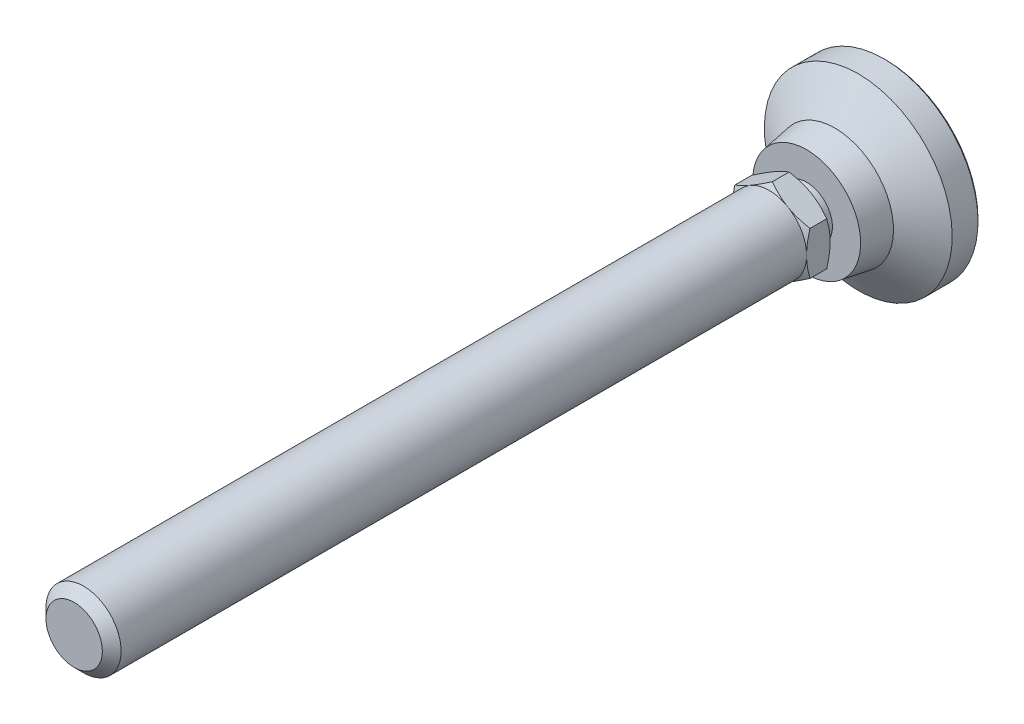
ISO-10303-21;
HEADER;
FILE_DESCRIPTION(('STEP AP214'),'2;1');
FILE_NAME('part.step','',(''),(''),'','','');
FILE_SCHEMA(('AUTOMOTIVE_DESIGN { 1 0 10303 214 1 1 1 1 }'));
ENDSEC;
DATA;
#1=APPLICATION_CONTEXT('core data for automotive mechanical design processes');
#2=APPLICATION_PROTOCOL_DEFINITION('international standard','automotive_design',2000,#1);
#3=PRODUCT_CONTEXT('',#1,'mechanical');
#4=PRODUCT('Part','Part','',(#3));
#5=PRODUCT_RELATED_PRODUCT_CATEGORY('part','',(#4));
#6=PRODUCT_DEFINITION_FORMATION('','',#4);
#7=PRODUCT_DEFINITION_CONTEXT('part definition',#1,'design');
#8=PRODUCT_DEFINITION('design','',#6,#7);
#9=PRODUCT_DEFINITION_SHAPE('','',#8);
#10=(LENGTH_UNIT() NAMED_UNIT(*) SI_UNIT(.MILLI.,.METRE.));
#11=(NAMED_UNIT(*) PLANE_ANGLE_UNIT() SI_UNIT($,.RADIAN.));
#12=(NAMED_UNIT(*) SI_UNIT($,.STERADIAN.) SOLID_ANGLE_UNIT());
#13=UNCERTAINTY_MEASURE_WITH_UNIT(LENGTH_MEASURE(1.E-05),#10,'distance_accuracy_value','');
#14=(GEOMETRIC_REPRESENTATION_CONTEXT(3) GLOBAL_UNCERTAINTY_ASSIGNED_CONTEXT((#13)) GLOBAL_UNIT_ASSIGNED_CONTEXT((#10,
#11,#12)) REPRESENTATION_CONTEXT('',''));
#15=CARTESIAN_POINT('',(0.,0.,0.));
#16=DIRECTION('',(0.,0.,1.));
#17=DIRECTION('',(1.,0.,0.));
#18=AXIS2_PLACEMENT_3D('',#15,#16,#17);
#19=CARTESIAN_POINT('',(0.,0.,-1.));
#20=DIRECTION('',(0.,0.,-1.));
#21=DIRECTION('',(0.,1.,0.));
#22=AXIS2_PLACEMENT_3D('',#19,#20,#21);
#23=CYLINDRICAL_SURFACE('',#22,20.);
#24=CARTESIAN_POINT('',(0.,0.,0.500000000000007));
#25=DIRECTION('',(0.,0.,-1.));
#26=DIRECTION('',(0.,1.,0.));
#27=AXIS2_PLACEMENT_3D('',#24,#25,#26);
#28=CIRCLE('',#27,20.);
#29=CARTESIAN_POINT('',(0.,20.,0.500000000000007));
#30=VERTEX_POINT('',#29);
#31=EDGE_CURVE('E163',#30,#30,#28,.F.);
#32=ORIENTED_EDGE('',*,*,#31,.T.);
#33=EDGE_LOOP('',(#32));
#34=FACE_BOUND('',#33,.T.);
#35=CARTESIAN_POINT('',(0.,0.,6.));
#36=DIRECTION('',(0.,0.,-1.));
#37=DIRECTION('',(0.,1.,0.));
#38=AXIS2_PLACEMENT_3D('',#35,#36,#37);
#39=CIRCLE('',#38,20.);
#40=CARTESIAN_POINT('',(0.,20.,6.));
#41=VERTEX_POINT('',#40);
#42=EDGE_CURVE('E143',#41,#41,#39,.T.);
#43=ORIENTED_EDGE('',*,*,#42,.T.);
#44=EDGE_LOOP('',(#43));
#45=FACE_BOUND('',#44,.T.);
#46=ADVANCED_FACE('F14',(#34,#45),#23,.T.);
#47=CARTESIAN_POINT('',(0.,0.,-1.));
#48=DIRECTION('',(0.,0.,-1.));
#49=DIRECTION('',(0.,1.,0.));
#50=AXIS2_PLACEMENT_3D('',#47,#48,#49);
#51=CYLINDRICAL_SURFACE('',#50,5.50000000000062);
#52=CARTESIAN_POINT('',(0.,0.,17.));
#53=DIRECTION('',(0.,0.,-1.));
#54=DIRECTION('',(0.,1.,0.));
#55=AXIS2_PLACEMENT_3D('',#52,#53,#54);
#56=CIRCLE('',#55,5.50000000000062);
#57=CARTESIAN_POINT('',(0.,5.50000000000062,17.));
#58=VERTEX_POINT('',#57);
#59=EDGE_CURVE('E153',#58,#58,#56,.T.);
#60=ORIENTED_EDGE('',*,*,#59,.F.);
#61=EDGE_LOOP('',(#60));
#62=FACE_BOUND('',#61,.T.);
#63=CARTESIAN_POINT('',(0.,0.,19.9999999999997));
#64=DIRECTION('',(0.,0.,-1.));
#65=DIRECTION('',(0.,1.,0.));
#66=AXIS2_PLACEMENT_3D('',#63,#64,#65);
#67=CIRCLE('',#66,5.50000000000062);
#68=CARTESIAN_POINT('',(0.,5.50000000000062,19.9999999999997));
#69=VERTEX_POINT('',#68);
#70=EDGE_CURVE('E134',#69,#69,#67,.T.);
#71=ORIENTED_EDGE('',*,*,#70,.T.);
#72=EDGE_LOOP('',(#71));
#73=FACE_BOUND('',#72,.T.);
#74=ADVANCED_FACE('F293',(#62,#73),#51,.T.);
#75=CARTESIAN_POINT('',(-11.5,0.,17.));
#76=DIRECTION('',(0.,0.,-1.));
#77=DIRECTION('',(0.,1.,0.));
#78=AXIS2_PLACEMENT_3D('',#75,#76,#77);
#79=PLANE('',#78);
#80=CARTESIAN_POINT('',(0.,0.,17.));
#81=DIRECTION('',(0.,0.,-1.));
#82=DIRECTION('',(0.,1.,0.));
#83=AXIS2_PLACEMENT_3D('',#80,#81,#82);
#84=CIRCLE('',#83,11.5);
#85=CARTESIAN_POINT('',(0.,11.5,17.));
#86=VERTEX_POINT('',#85);
#87=EDGE_CURVE('E150',#86,#86,#84,.T.);
#88=ORIENTED_EDGE('',*,*,#87,.F.);
#89=EDGE_LOOP('',(#88));
#90=FACE_BOUND('',#89,.T.);
#91=ORIENTED_EDGE('',*,*,#59,.T.);
#92=EDGE_LOOP('',(#91));
#93=FACE_BOUND('',#92,.T.);
#94=ADVANCED_FACE('F299',(#90,#93),#79,.F.);
#95=CARTESIAN_POINT('',(0.,0.,17.));
#96=DIRECTION('',(0.,0.,-1.));
#97=DIRECTION('',(0.,1.,0.));
#98=AXIS2_PLACEMENT_3D('',#95,#96,#97);
#99=CONICAL_SURFACE('',#98,11.5,0.165148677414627);
#100=CARTESIAN_POINT('',(0.,0.,11.));
#101=DIRECTION('',(0.,0.,-1.));
#102=DIRECTION('',(0.,1.,0.));
#103=AXIS2_PLACEMENT_3D('',#100,#101,#102);
#104=CIRCLE('',#103,12.5);
#105=CARTESIAN_POINT('',(0.,12.5,11.));
#106=VERTEX_POINT('',#105);
#107=EDGE_CURVE('E146',#106,#106,#104,.T.);
#108=ORIENTED_EDGE('',*,*,#107,.F.);
#109=EDGE_LOOP('',(#108));
#110=FACE_BOUND('',#109,.T.);
#111=ORIENTED_EDGE('',*,*,#87,.T.);
#112=EDGE_LOOP('',(#111));
#113=FACE_BOUND('',#112,.T.);
#114=ADVANCED_FACE('F308',(#110,#113),#99,.T.);
#115=CARTESIAN_POINT('',(0.,0.,11.));
#116=DIRECTION('',(0.,0.,-1.));
#117=DIRECTION('',(0.,1.,0.));
#118=AXIS2_PLACEMENT_3D('',#115,#116,#117);
#119=CONICAL_SURFACE('',#118,12.5,0.982793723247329);
#120=ORIENTED_EDGE('',*,*,#42,.F.);
#121=EDGE_LOOP('',(#120));
#122=FACE_BOUND('',#121,.T.);
#123=ORIENTED_EDGE('',*,*,#107,.T.);
#124=EDGE_LOOP('',(#123));
#125=FACE_BOUND('',#124,.T.);
#126=ADVANCED_FACE('F304',(#122,#125),#119,.T.);
#127=CARTESIAN_POINT('',(0.,0.,0.));
#128=DIRECTION('',(0.,0.,-1.));
#129=DIRECTION('',(0.,1.,0.));
#130=AXIS2_PLACEMENT_3D('',#127,#128,#129);
#131=PLANE('',#130);
#132=CARTESIAN_POINT('',(0.,0.,0.));
#133=DIRECTION('',(0.,0.,-1.));
#134=DIRECTION('',(0.,1.,0.));
#135=AXIS2_PLACEMENT_3D('',#132,#133,#134);
#136=CIRCLE('',#135,19.5);
#137=CARTESIAN_POINT('',(0.,19.5,0.));
#138=VERTEX_POINT('',#137);
#139=EDGE_CURVE('E160',#138,#138,#136,.T.);
#140=ORIENTED_EDGE('',*,*,#139,.T.);
#141=EDGE_LOOP('',(#140));
#142=FACE_BOUND('',#141,.T.);
#143=ADVANCED_FACE('F307',(#142),#131,.T.);
#144=CARTESIAN_POINT('',(0.,-5.50000000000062,19.9999999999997));
#145=DIRECTION('',(0.,0.,-1.));
#146=DIRECTION('',(0.,1.,0.));
#147=AXIS2_PLACEMENT_3D('',#144,#145,#146);
#148=PLANE('',#147);
#149=CARTESIAN_POINT('',(0.,0.,19.9999999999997));
#150=DIRECTION('',(0.,0.,1.));
#151=DIRECTION('',(0.,-1.,0.));
#152=AXIS2_PLACEMENT_3D('',#149,#150,#151);
#153=CIRCLE('',#152,8.00000000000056);
#154=CARTESIAN_POINT('',(-4.,6.92820323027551,19.9999999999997));
#155=VERTEX_POINT('',#154);
#156=CARTESIAN_POINT('',(-8.,0.,19.9999999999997));
#157=VERTEX_POINT('',#156);
#158=EDGE_CURVE('E397',#155,#157,#153,.T.);
#159=ORIENTED_EDGE('',*,*,#158,.F.);
#160=CARTESIAN_POINT('',(4.,6.92820323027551,19.9999999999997));
#161=VERTEX_POINT('',#160);
#162=EDGE_CURVE('E115',#161,#155,#153,.T.);
#163=ORIENTED_EDGE('',*,*,#162,.F.);
#164=CARTESIAN_POINT('',(8.,0.,19.9999999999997));
#165=VERTEX_POINT('',#164);
#166=EDGE_CURVE('E403',#165,#161,#153,.T.);
#167=ORIENTED_EDGE('',*,*,#166,.F.);
#168=CARTESIAN_POINT('',(4.,-6.92820323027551,19.9999999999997));
#169=VERTEX_POINT('',#168);
#170=EDGE_CURVE('E35',#169,#165,#153,.T.);
#171=ORIENTED_EDGE('',*,*,#170,.F.);
#172=CARTESIAN_POINT('',(-4.,-6.92820323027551,19.9999999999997));
#173=VERTEX_POINT('',#172);
#174=EDGE_CURVE('E43',#173,#169,#153,.T.);
#175=ORIENTED_EDGE('',*,*,#174,.F.);
#176=EDGE_CURVE('E400',#157,#173,#153,.T.);
#177=ORIENTED_EDGE('',*,*,#176,.F.);
#178=EDGE_LOOP('',(#159,#163,#167,#171,#175,#177));
#179=FACE_BOUND('',#178,.T.);
#180=ORIENTED_EDGE('',*,*,#70,.F.);
#181=EDGE_LOOP('',(#180));
#182=FACE_BOUND('',#181,.T.);
#183=ADVANCED_FACE('F386',(#179,#182),#148,.T.);
#184=CARTESIAN_POINT('',(0.,0.,0.));
#185=DIRECTION('',(0.,0.,1.));
#186=DIRECTION('',(0.,-1.,0.));
#187=AXIS2_PLACEMENT_3D('',#184,#185,#186);
#188=CONICAL_SURFACE('',#187,19.5,0.785398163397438);
#189=ORIENTED_EDGE('',*,*,#31,.F.);
#190=EDGE_LOOP('',(#189));
#191=FACE_BOUND('',#190,.T.);
#192=ORIENTED_EDGE('',*,*,#139,.F.);
#193=EDGE_LOOP('',(#192));
#194=FACE_BOUND('',#193,.T.);
#195=ADVANCED_FACE('F16',(#191,#194),#188,.T.);
#196=CARTESIAN_POINT('',(0.,0.,19.9999999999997));
#197=DIRECTION('',(0.,0.,1.));
#198=DIRECTION('',(0.,-1.,0.));
#199=AXIS2_PLACEMENT_3D('',#196,#197,#198);
#200=CONICAL_SURFACE('',#199,8.00000000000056,1.0471975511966);
#201=CARTESIAN_POINT('',(-0.00019999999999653,9.23771977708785,20.7145978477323));
#202=CARTESIAN_POINT('',(0.1756487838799,9.13619343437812,20.6559907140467));
#203=CARTESIAN_POINT('',(0.352153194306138,9.03428856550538,20.6000434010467));
#204=CARTESIAN_POINT('',(0.706595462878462,8.82965122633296,20.494201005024));
#205=CARTESIAN_POINT('',(0.884533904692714,8.72691841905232,20.4443085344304));
#206=CARTESIAN_POINT('',(1.42119823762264,8.41707512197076,20.3046927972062));
#207=CARTESIAN_POINT('',(1.78204258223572,8.20874154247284,20.2252811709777));
#208=CARTESIAN_POINT('',(2.32203917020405,7.89697436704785,20.1321616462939));
#209=CARTESIAN_POINT('',(2.49957818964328,7.79447216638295,20.1056345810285));
#210=CARTESIAN_POINT('',(2.8554591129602,7.58900421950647,20.0611531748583));
#211=CARTESIAN_POINT('',(3.03380094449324,7.4860385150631,20.043198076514));
#212=CARTESIAN_POINT('',(3.39079168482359,7.27992981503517,20.0163156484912));
#213=CARTESIAN_POINT('',(3.5694400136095,7.17678715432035,20.0073780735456));
#214=CARTESIAN_POINT('',(3.92690170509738,6.97040655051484,19.9987223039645));
#215=CARTESIAN_POINT('',(4.10571506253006,6.86716861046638,19.9990038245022));
#216=CARTESIAN_POINT('',(4.4400133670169,6.67416139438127,20.0081450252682));
#217=CARTESIAN_POINT('',(4.59552190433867,6.58437849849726,20.0158896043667));
#218=CARTESIAN_POINT('',(4.90617476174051,6.40502298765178,20.0382011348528));
#219=CARTESIAN_POINT('',(5.06131905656,6.31545038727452,20.0527685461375));
#220=CARTESIAN_POINT('',(5.52615131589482,6.04707935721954,20.1063606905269));
#221=CARTESIAN_POINT('',(5.83501648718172,5.86875596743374,20.1552686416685));
#222=CARTESIAN_POINT('',(6.4560232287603,5.51021755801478,20.2775394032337));
#223=CARTESIAN_POINT('',(6.76808554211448,5.33004829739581,20.3514205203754));
#224=CARTESIAN_POINT('',(7.38755648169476,4.97239658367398,20.5191001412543));
#225=CARTESIAN_POINT('',(7.69497304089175,4.79490955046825,20.6128592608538));
#226=CARTESIAN_POINT('',(8.0002,4.61868668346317,20.7145978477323));
#227=B_SPLINE_CURVE_WITH_KNOTS('',3,(#201,#202,#203,#204,#205,#206,#207,#208,#209,#210,#211,
#212,#213,#214,#215,#216,#217,#218,#219,#220,#221,#222,#223,#224,#225,#226),.UNSPECIFIED.,.F.,
.F.,(4,2,2,2,2,2,2,2,2,2,2,2,4),(0.,0.63397354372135,1.26821965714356,2.53934712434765,
3.15934343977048,3.77928496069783,4.39852133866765,5.01773858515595,5.55680239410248,
6.09590254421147,7.17487077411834,8.27776850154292,9.37850115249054),.UNSPECIFIED.);
#228=CARTESIAN_POINT('',(0.,9.23760430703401,20.7145311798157));
#229=VERTEX_POINT('',#228);
#230=EDGE_CURVE('E112',#229,#161,#227,.T.);
#231=ORIENTED_EDGE('',*,*,#230,.T.);
#232=ORIENTED_EDGE('',*,*,#162,.T.);
#233=CARTESIAN_POINT('',(-8.0002,4.61868668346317,20.7145978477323));
#234=CARTESIAN_POINT('',(-7.8243512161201,4.7202130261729,20.6559907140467));
#235=CARTESIAN_POINT('',(-7.64784680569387,4.82211789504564,20.6000434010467));
#236=CARTESIAN_POINT('',(-7.29340453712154,5.02675523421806,20.494201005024));
#237=CARTESIAN_POINT('',(-7.11546609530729,5.1294880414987,20.4443085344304));
#238=CARTESIAN_POINT('',(-6.57880176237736,5.43933133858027,20.3046927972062));
#239=CARTESIAN_POINT('',(-6.21795741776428,5.64766491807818,20.2252811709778));
#240=CARTESIAN_POINT('',(-5.67796082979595,5.95943209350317,20.1321616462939));
#241=CARTESIAN_POINT('',(-5.50042181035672,6.06193429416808,20.1056345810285));
#242=CARTESIAN_POINT('',(-5.1445408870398,6.26740224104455,20.0611531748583));
#243=CARTESIAN_POINT('',(-4.96619905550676,6.37036794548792,20.043198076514));
#244=CARTESIAN_POINT('',(-4.60920831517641,6.57647664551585,20.0163156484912));
#245=CARTESIAN_POINT('',(-4.4305599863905,6.67961930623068,20.0073780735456));
#246=CARTESIAN_POINT('',(-4.07309829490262,6.88599991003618,19.9987223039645));
#247=CARTESIAN_POINT('',(-3.89428493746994,6.98923785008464,19.9990038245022));
#248=CARTESIAN_POINT('',(-3.5599866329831,7.18224506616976,20.0081450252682));
#249=CARTESIAN_POINT('',(-3.40447809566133,7.27202796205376,20.0158896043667));
#250=CARTESIAN_POINT('',(-3.09382523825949,7.45138347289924,20.0382011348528));
#251=CARTESIAN_POINT('',(-2.93868094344,7.54095607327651,20.0527685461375));
#252=CARTESIAN_POINT('',(-2.47384868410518,7.80932710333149,20.1063606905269));
#253=CARTESIAN_POINT('',(-2.16498351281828,7.98765049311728,20.1552686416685));
#254=CARTESIAN_POINT('',(-1.5439767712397,8.34618890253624,20.2775394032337));
#255=CARTESIAN_POINT('',(-1.23191445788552,8.52635816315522,20.3514205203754));
#256=CARTESIAN_POINT('',(-0.612443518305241,8.88400987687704,20.5191001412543));
#257=CARTESIAN_POINT('',(-0.305026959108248,9.06149691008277,20.6128592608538));
#258=CARTESIAN_POINT('',(0.000200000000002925,9.23771977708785,20.7145978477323));
#259=B_SPLINE_CURVE_WITH_KNOTS('',3,(#233,#234,#235,#236,#237,#238,#239,#240,#241,#242,#243,
#244,#245,#246,#247,#248,#249,#250,#251,#252,#253,#254,#255,#256,#257,#258),.UNSPECIFIED.,.F.,
.F.,(4,2,2,2,2,2,2,2,2,2,2,2,4),(0.,0.633973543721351,1.26821965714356,2.53934712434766,
3.15934343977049,3.77928496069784,4.39852133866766,5.01773858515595,5.55680239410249,
6.09590254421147,7.17487077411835,8.27776850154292,9.37850115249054),.UNSPECIFIED.);
#260=EDGE_CURVE('E18',#155,#229,#259,.T.);
#261=ORIENTED_EDGE('',*,*,#260,.T.);
#262=EDGE_LOOP('',(#231,#232,#261));
#263=FACE_BOUND('',#262,.T.);
#264=ADVANCED_FACE('F111',(#263),#200,.T.);
#265=CARTESIAN_POINT('',(-8.,12.3152893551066,23.8599232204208));
#266=CARTESIAN_POINT('',(-8.,11.9666358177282,23.6911645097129));
#267=CARTESIAN_POINT('',(-8.,11.6171720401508,23.5240505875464));
#268=CARTESIAN_POINT('',(-8.,10.9161927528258,23.1940392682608));
#269=CARTESIAN_POINT('',(-8.,10.5646769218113,23.0311425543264));
#270=CARTESIAN_POINT('',(-8.,9.85730685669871,22.7096533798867));
#271=CARTESIAN_POINT('',(-8.,9.50143935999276,22.5510899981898));
#272=CARTESIAN_POINT('',(-8.,8.78684181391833,22.2405754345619));
#273=CARTESIAN_POINT('',(-8.,8.4281119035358,22.0886239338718));
#274=CARTESIAN_POINT('',(-8.,7.69599116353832,21.7884789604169));
#275=CARTESIAN_POINT('',(-8.,7.32249146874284,21.6405495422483));
#276=CARTESIAN_POINT('',(-8.,6.57108964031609,21.3561094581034));
#277=CARTESIAN_POINT('',(-8.,6.19318701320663,21.2196000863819));
#278=CARTESIAN_POINT('',(-8.,5.43311095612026,20.9616514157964));
#279=CARTESIAN_POINT('',(-8.,5.05094827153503,20.8401807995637));
#280=CARTESIAN_POINT('',(-8.,4.2811561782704,20.6162657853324));
#281=CARTESIAN_POINT('',(-8.,3.89352856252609,20.5138152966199));
#282=CARTESIAN_POINT('',(-8.,3.11465872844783,20.3334648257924));
#283=CARTESIAN_POINT('',(-8.,2.72344742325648,20.2554349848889));
#284=CARTESIAN_POINT('',(-8.,2.1331422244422,20.1601282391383));
#285=CARTESIAN_POINT('',(-8.,1.93577721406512,20.1319810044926));
#286=CARTESIAN_POINT('',(-8.,1.54009759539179,20.0834865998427));
#287=CARTESIAN_POINT('',(-8.,1.34178308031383,20.0631386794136));
#288=CARTESIAN_POINT('',(-8.,0.947020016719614,20.0308987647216));
#289=CARTESIAN_POINT('',(-8.,0.750580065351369,20.0189018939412));
#290=CARTESIAN_POINT('',(-8.,0.357369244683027,20.0032193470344));
#291=CARTESIAN_POINT('',(-8.,0.160598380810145,19.9995335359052));
#292=CARTESIAN_POINT('',(-8.,-0.232923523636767,20.000560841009));
#293=CARTESIAN_POINT('',(-8.,-0.429674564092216,20.0052740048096));
#294=CARTESIAN_POINT('',(-8.,-0.822805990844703,20.022985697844));
#295=CARTESIAN_POINT('',(-8.,-1.01918635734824,20.0359846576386));
#296=CARTESIAN_POINT('',(-8.,-1.49396474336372,20.0771559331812));
#297=CARTESIAN_POINT('',(-8.,-1.77201548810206,20.1094158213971));
#298=CARTESIAN_POINT('',(-8.,-2.32597953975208,20.1887644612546));
#299=CARTESIAN_POINT('',(-8.,-2.60189253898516,20.2358553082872));
#300=CARTESIAN_POINT('',(-8.,-3.4261516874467,20.3968708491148));
#301=CARTESIAN_POINT('',(-8.,-3.97069415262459,20.5305068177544));
#302=CARTESIAN_POINT('',(-8.,-4.78479126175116,20.7613060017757));
#303=CARTESIAN_POINT('',(-8.,-5.0585921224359,20.8443450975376));
#304=CARTESIAN_POINT('',(-8.,-5.60353316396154,21.0188150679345));
#305=CARTESIAN_POINT('',(-8.,-5.87467332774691,21.1102459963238));
#306=CARTESIAN_POINT('',(-8.,-6.41438262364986,21.3000521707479));
#307=CARTESIAN_POINT('',(-8.,-6.68295262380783,21.3984249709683));
#308=CARTESIAN_POINT('',(-8.,-7.21788349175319,21.6009807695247));
#309=CARTESIAN_POINT('',(-8.,-7.4842443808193,21.7051637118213));
#310=CARTESIAN_POINT('',(-8.,-8.0930800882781,21.9497344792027));
#311=CARTESIAN_POINT('',(-8.,-8.43489667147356,22.0917574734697));
#312=CARTESIAN_POINT('',(-8.,-9.1157796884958,22.382266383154));
#313=CARTESIAN_POINT('',(-8.,-9.4548459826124,22.5307526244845));
#314=CARTESIAN_POINT('',(-8.,-10.1307153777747,22.8329468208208));
#315=CARTESIAN_POINT('',(-8.,-10.4675180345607,22.9866557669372));
#316=CARTESIAN_POINT('',(-8.,-11.1391572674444,23.2982871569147));
#317=CARTESIAN_POINT('',(-8.,-11.4739938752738,23.4562095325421));
#318=CARTESIAN_POINT('',(-8.,-12.1423156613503,23.7756536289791));
#319=CARTESIAN_POINT('',(-8.,-12.475799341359,23.9371784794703));
#320=CARTESIAN_POINT('',(-8.,-13.141362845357,24.2630974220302));
#321=CARTESIAN_POINT('',(-8.,-13.4734426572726,24.4274915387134));
#322=CARTESIAN_POINT('',(-8.,-14.4679137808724,24.924249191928));
#323=CARTESIAN_POINT('',(-8.,-15.1285232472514,25.260181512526));
#324=CARTESIAN_POINT('',(-8.,-16.0907733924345,25.7557573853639));
#325=CARTESIAN_POINT('',(-8.,-16.3937978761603,25.9127307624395));
#326=CARTESIAN_POINT('',(-8.,-16.9991858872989,26.227935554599));
#327=CARTESIAN_POINT('',(-8.,-17.3015494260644,26.3861669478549));
#328=CARTESIAN_POINT('',(-8.,-18.2078023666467,26.8625086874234));
#329=CARTESIAN_POINT('',(-8.,-18.8108317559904,27.1822550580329));
#330=CARTESIAN_POINT('',(-8.,-20.0137415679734,27.8243667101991));
#331=CARTESIAN_POINT('',(-8.,-20.6136260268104,28.1467244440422));
#332=CARTESIAN_POINT('',(-8.,-21.8119289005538,28.7940829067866));
#333=CARTESIAN_POINT('',(-8.,-22.4103473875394,29.1190835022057));
#334=CARTESIAN_POINT('',(-8.,-23.0082202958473,29.4450783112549));
#335=B_SPLINE_CURVE_WITH_KNOTS('',3,(#265,#266,#267,#268,#269,#270,#271,#272,#273,#274,#275,
#276,#277,#278,#279,#280,#281,#282,#283,#284,#285,#286,#287,#288,#289,#290,#291,#292,#293,#294,
#295,#296,#297,#298,#299,#300,#301,#302,#303,#304,#305,#306,#307,#308,#309,#310,#311,#312,#313,
#314,#315,#316,#317,#318,#319,#320,#321,#322,#323,#324,#325,#326,#327,#328,#329,#330,#331,#332,
#333,#334),.UNSPECIFIED.,.F.,.F.,(4,2,2,2,2,2,2,2,2,2,2,2,2,2,2,2,2,2,2,2,2,2,2,2,2,2,2,2,2,2,2,
2,2,2,4),(0.,1.16205987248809,2.32430683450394,3.49303705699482,4.6617108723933,
5.86674910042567,7.07192371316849,8.27454482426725,9.47678015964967,10.6725093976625,
11.2704655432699,11.8683641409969,12.4586115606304,13.0488493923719,13.6390905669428,
14.2293624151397,15.0686339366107,15.9080240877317,17.587776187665,18.4460558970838,
19.3043411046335,20.1623254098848,21.0203014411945,22.1306562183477,23.2410670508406,
24.3516897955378,25.4622945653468,26.5739049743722,27.6855249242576,29.9088098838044,
30.9326156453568,31.9564036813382,34.0040551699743,36.0470810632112,38.0900044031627),.UNSPECIFIED.);
#336=CARTESIAN_POINT('',(-8.,4.61880215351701,20.7145311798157));
#337=VERTEX_POINT('',#336);
#338=EDGE_CURVE('E367',#157,#337,#335,.F.);
#339=ORIENTED_EDGE('',*,*,#338,.T.);
#340=EDGE_CURVE('E9',#337,#155,#259,.T.);
#341=ORIENTED_EDGE('',*,*,#340,.T.);
#342=ORIENTED_EDGE('',*,*,#158,.T.);
#343=EDGE_LOOP('',(#339,#341,#342));
#344=FACE_BOUND('',#343,.T.);
#345=ADVANCED_FACE('F181',(#344),#200,.T.);
#346=CARTESIAN_POINT('',(0.000200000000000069,-9.23771977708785,20.7145978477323));
#347=CARTESIAN_POINT('',(-0.175648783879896,-9.13619343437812,20.6559907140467));
#348=CARTESIAN_POINT('',(-0.352153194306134,-9.03428856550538,20.6000434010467));
#349=CARTESIAN_POINT('',(-0.706595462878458,-8.82965122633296,20.494201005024));
#350=CARTESIAN_POINT('',(-0.88453390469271,-8.72691841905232,20.4443085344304));
#351=CARTESIAN_POINT('',(-1.42119823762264,-8.41707512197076,20.3046927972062));
#352=CARTESIAN_POINT('',(-1.78204258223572,-8.20874154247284,20.2252811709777));
#353=CARTESIAN_POINT('',(-2.32203917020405,-7.89697436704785,20.1321616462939));
#354=CARTESIAN_POINT('',(-2.49957818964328,-7.79447216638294,20.1056345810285));
#355=CARTESIAN_POINT('',(-2.8554591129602,-7.58900421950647,20.0611531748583));
#356=CARTESIAN_POINT('',(-3.03380094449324,-7.4860385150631,20.043198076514));
#357=CARTESIAN_POINT('',(-3.39079168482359,-7.27992981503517,20.0163156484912));
#358=CARTESIAN_POINT('',(-3.5694400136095,-7.17678715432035,20.0073780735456));
#359=CARTESIAN_POINT('',(-3.92690170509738,-6.97040655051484,19.9987223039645));
#360=CARTESIAN_POINT('',(-4.10571506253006,-6.86716861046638,19.9990038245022));
#361=CARTESIAN_POINT('',(-4.4400133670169,-6.67416139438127,20.0081450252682));
#362=CARTESIAN_POINT('',(-4.59552190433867,-6.58437849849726,20.0158896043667));
#363=CARTESIAN_POINT('',(-4.90617476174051,-6.40502298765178,20.0382011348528));
#364=CARTESIAN_POINT('',(-5.06131905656,-6.31545038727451,20.0527685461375));
#365=CARTESIAN_POINT('',(-5.52615131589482,-6.04707935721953,20.1063606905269));
#366=CARTESIAN_POINT('',(-5.83501648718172,-5.86875596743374,20.1552686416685));
#367=CARTESIAN_POINT('',(-6.4560232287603,-5.51021755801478,20.2775394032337));
#368=CARTESIAN_POINT('',(-6.76808554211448,-5.3300482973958,20.3514205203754));
#369=CARTESIAN_POINT('',(-7.38755648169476,-4.97239658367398,20.5191001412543));
#370=CARTESIAN_POINT('',(-7.69497304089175,-4.79490955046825,20.6128592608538));
#371=CARTESIAN_POINT('',(-8.0002,-4.61868668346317,20.7145978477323));
#372=B_SPLINE_CURVE_WITH_KNOTS('',3,(#346,#347,#348,#349,#350,#351,#352,#353,#354,#355,#356,
#357,#358,#359,#360,#361,#362,#363,#364,#365,#366,#367,#368,#369,#370,#371),.UNSPECIFIED.,.F.,
.F.,(4,2,2,2,2,2,2,2,2,2,2,2,4),(0.,0.633973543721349,1.26821965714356,2.53934712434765,
3.15934343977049,3.77928496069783,4.39852133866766,5.01773858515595,5.55680239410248,
6.09590254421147,7.17487077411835,8.27776850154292,9.37850115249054),.UNSPECIFIED.);
#373=CARTESIAN_POINT('',(-8.,-4.618802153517,20.7145311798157));
#374=VERTEX_POINT('',#373);
#375=EDGE_CURVE('E359',#173,#374,#372,.T.);
#376=ORIENTED_EDGE('',*,*,#375,.T.);
#377=EDGE_CURVE('E361',#374,#157,#335,.F.);
#378=ORIENTED_EDGE('',*,*,#377,.T.);
#379=ORIENTED_EDGE('',*,*,#176,.T.);
#380=EDGE_LOOP('',(#376,#378,#379));
#381=FACE_BOUND('',#380,.T.);
#382=ADVANCED_FACE('F417',(#381),#200,.T.);
#383=CARTESIAN_POINT('',(8.0002,-4.61868668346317,20.7145978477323));
#384=CARTESIAN_POINT('',(7.8243512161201,-4.7202130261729,20.6559907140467));
#385=CARTESIAN_POINT('',(7.64784680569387,-4.82211789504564,20.6000434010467));
#386=CARTESIAN_POINT('',(7.29340453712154,-5.02675523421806,20.494201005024));
#387=CARTESIAN_POINT('',(7.11546609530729,-5.1294880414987,20.4443085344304));
#388=CARTESIAN_POINT('',(6.57880176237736,-5.43933133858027,20.3046927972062));
#389=CARTESIAN_POINT('',(6.21795741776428,-5.64766491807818,20.2252811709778));
#390=CARTESIAN_POINT('',(5.67796082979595,-5.95943209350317,20.1321616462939));
#391=CARTESIAN_POINT('',(5.50042181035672,-6.06193429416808,20.1056345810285));
#392=CARTESIAN_POINT('',(5.1445408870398,-6.26740224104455,20.0611531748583));
#393=CARTESIAN_POINT('',(4.96619905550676,-6.37036794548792,20.043198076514));
#394=CARTESIAN_POINT('',(4.60920831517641,-6.57647664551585,20.0163156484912));
#395=CARTESIAN_POINT('',(4.4305599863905,-6.67961930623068,20.0073780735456));
#396=CARTESIAN_POINT('',(4.07309829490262,-6.88599991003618,19.9987223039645));
#397=CARTESIAN_POINT('',(3.89428493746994,-6.98923785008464,19.9990038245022));
#398=CARTESIAN_POINT('',(3.5599866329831,-7.18224506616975,20.0081450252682));
#399=CARTESIAN_POINT('',(3.40447809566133,-7.27202796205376,20.0158896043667));
#400=CARTESIAN_POINT('',(3.09382523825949,-7.45138347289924,20.0382011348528));
#401=CARTESIAN_POINT('',(2.93868094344,-7.54095607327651,20.0527685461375));
#402=CARTESIAN_POINT('',(2.47384868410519,-7.80932710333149,20.1063606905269));
#403=CARTESIAN_POINT('',(2.16498351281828,-7.98765049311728,20.1552686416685));
#404=CARTESIAN_POINT('',(1.5439767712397,-8.34618890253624,20.2775394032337));
#405=CARTESIAN_POINT('',(1.23191445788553,-8.52635816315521,20.3514205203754));
#406=CARTESIAN_POINT('',(0.612443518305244,-8.88400987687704,20.5191001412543));
#407=CARTESIAN_POINT('',(0.305026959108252,-9.06149691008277,20.6128592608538));
#408=CARTESIAN_POINT('',(-0.00019999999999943,-9.23771977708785,20.7145978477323));
#409=B_SPLINE_CURVE_WITH_KNOTS('',3,(#383,#384,#385,#386,#387,#388,#389,#390,#391,#392,#393,
#394,#395,#396,#397,#398,#399,#400,#401,#402,#403,#404,#405,#406,#407,#408),.UNSPECIFIED.,.F.,
.F.,(4,2,2,2,2,2,2,2,2,2,2,2,4),(0.,0.633973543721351,1.26821965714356,2.53934712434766,
3.15934343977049,3.77928496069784,4.39852133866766,5.01773858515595,5.55680239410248,
6.09590254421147,7.17487077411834,8.27776850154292,9.37850115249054),.UNSPECIFIED.);
#410=CARTESIAN_POINT('',(0.,-9.23760430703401,20.7145311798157));
#411=VERTEX_POINT('',#410);
#412=EDGE_CURVE('E244',#169,#411,#409,.T.);
#413=ORIENTED_EDGE('',*,*,#412,.T.);
#414=EDGE_CURVE('E357',#411,#173,#372,.T.);
#415=ORIENTED_EDGE('',*,*,#414,.T.);
#416=ORIENTED_EDGE('',*,*,#174,.T.);
#417=EDGE_LOOP('',(#413,#415,#416));
#418=FACE_BOUND('',#417,.T.);
#419=ADVANCED_FACE('F411',(#418),#200,.T.);
#420=CARTESIAN_POINT('',(8.,12.3152893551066,23.8599232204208));
#421=CARTESIAN_POINT('',(8.,11.9666358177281,23.6911645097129));
#422=CARTESIAN_POINT('',(8.,11.6171720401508,23.5240505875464));
#423=CARTESIAN_POINT('',(8.,10.9161927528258,23.1940392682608));
#424=CARTESIAN_POINT('',(8.,10.5646769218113,23.0311425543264));
#425=CARTESIAN_POINT('',(8.,9.8573068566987,22.7096533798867));
#426=CARTESIAN_POINT('',(8.,9.50143935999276,22.5510899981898));
#427=CARTESIAN_POINT('',(8.,8.78684181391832,22.2405754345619));
#428=CARTESIAN_POINT('',(8.,8.4281119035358,22.0886239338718));
#429=CARTESIAN_POINT('',(8.,7.69599116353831,21.7884789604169));
#430=CARTESIAN_POINT('',(8.,7.32249146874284,21.6405495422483));
#431=CARTESIAN_POINT('',(8.,6.57108964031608,21.3561094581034));
#432=CARTESIAN_POINT('',(8.,6.19318701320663,21.2196000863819));
#433=CARTESIAN_POINT('',(8.,5.43311095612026,20.9616514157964));
#434=CARTESIAN_POINT('',(8.,5.05094827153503,20.8401807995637));
#435=CARTESIAN_POINT('',(8.,4.2811561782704,20.6162657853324));
#436=CARTESIAN_POINT('',(8.,3.89352856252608,20.5138152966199));
#437=CARTESIAN_POINT('',(8.,3.11465872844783,20.3334648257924));
#438=CARTESIAN_POINT('',(8.,2.72344742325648,20.2554349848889));
#439=CARTESIAN_POINT('',(8.,2.1331422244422,20.1601282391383));
#440=CARTESIAN_POINT('',(8.,1.93577721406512,20.1319810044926));
#441=CARTESIAN_POINT('',(8.,1.54009759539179,20.0834865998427));
#442=CARTESIAN_POINT('',(8.,1.34178308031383,20.0631386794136));
#443=CARTESIAN_POINT('',(8.,0.947020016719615,20.0308987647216));
#444=CARTESIAN_POINT('',(8.,0.75058006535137,20.0189018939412));
#445=CARTESIAN_POINT('',(8.,0.357369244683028,20.0032193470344));
#446=CARTESIAN_POINT('',(8.,0.160598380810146,19.9995335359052));
#447=CARTESIAN_POINT('',(8.,-0.232923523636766,20.000560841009));
#448=CARTESIAN_POINT('',(8.,-0.429674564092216,20.0052740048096));
#449=CARTESIAN_POINT('',(8.,-0.822805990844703,20.022985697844));
#450=CARTESIAN_POINT('',(8.,-1.01918635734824,20.0359846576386));
#451=CARTESIAN_POINT('',(8.,-1.49396474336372,20.0771559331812));
#452=CARTESIAN_POINT('',(8.,-1.77201548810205,20.1094158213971));
#453=CARTESIAN_POINT('',(8.,-2.32597953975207,20.1887644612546));
#454=CARTESIAN_POINT('',(8.,-2.60189253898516,20.2358553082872));
#455=CARTESIAN_POINT('',(8.,-3.4261516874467,20.3968708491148));
#456=CARTESIAN_POINT('',(8.,-3.97069415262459,20.5305068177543));
#457=CARTESIAN_POINT('',(8.,-4.78479126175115,20.7613060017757));
#458=CARTESIAN_POINT('',(8.,-5.0585921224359,20.8443450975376));
#459=CARTESIAN_POINT('',(8.,-5.60353316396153,21.0188150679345));
#460=CARTESIAN_POINT('',(8.,-5.8746733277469,21.1102459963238));
#461=CARTESIAN_POINT('',(8.,-6.41438262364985,21.3000521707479));
#462=CARTESIAN_POINT('',(8.,-6.68295262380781,21.3984249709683));
#463=CARTESIAN_POINT('',(8.,-7.21788349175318,21.6009807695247));
#464=CARTESIAN_POINT('',(8.,-7.4842443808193,21.7051637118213));
#465=CARTESIAN_POINT('',(8.,-8.0930800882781,21.9497344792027));
#466=CARTESIAN_POINT('',(8.,-8.43489667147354,22.0917574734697));
#467=CARTESIAN_POINT('',(8.,-9.11577968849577,22.382266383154));
#468=CARTESIAN_POINT('',(8.,-9.45484598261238,22.5307526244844));
#469=CARTESIAN_POINT('',(8.,-10.1307153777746,22.8329468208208));
#470=CARTESIAN_POINT('',(8.,-10.4675180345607,22.9866557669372));
#471=CARTESIAN_POINT('',(8.,-11.1391572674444,23.2982871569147));
#472=CARTESIAN_POINT('',(8.,-11.4739938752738,23.4562095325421));
#473=CARTESIAN_POINT('',(8.,-12.1423156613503,23.7756536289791));
#474=CARTESIAN_POINT('',(8.,-12.4757993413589,23.9371784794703));
#475=CARTESIAN_POINT('',(8.,-13.141362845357,24.2630974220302));
#476=CARTESIAN_POINT('',(8.,-13.4734426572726,24.4274915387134));
#477=CARTESIAN_POINT('',(8.,-14.4679137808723,24.924249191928));
#478=CARTESIAN_POINT('',(8.,-15.1285232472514,25.260181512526));
#479=CARTESIAN_POINT('',(8.,-16.0907733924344,25.7557573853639));
#480=CARTESIAN_POINT('',(8.,-16.3937978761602,25.9127307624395));
#481=CARTESIAN_POINT('',(8.,-16.9991858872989,26.227935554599));
#482=CARTESIAN_POINT('',(8.,-17.3015494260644,26.3861669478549));
#483=CARTESIAN_POINT('',(8.,-18.2078023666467,26.8625086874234));
#484=CARTESIAN_POINT('',(7.99999999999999,-18.8108317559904,27.1822550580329));
#485=CARTESIAN_POINT('',(7.99999999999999,-20.0137415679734,27.8243667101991));
#486=CARTESIAN_POINT('',(7.99999999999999,-20.6136260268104,28.1467244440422));
#487=CARTESIAN_POINT('',(7.99999999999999,-21.8119289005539,28.7940829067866));
#488=CARTESIAN_POINT('',(8.,-22.4103473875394,29.1190835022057));
#489=CARTESIAN_POINT('',(8.,-23.0082202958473,29.4450783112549));
#490=B_SPLINE_CURVE_WITH_KNOTS('',3,(#420,#421,#422,#423,#424,#425,#426,#427,#428,#429,#430,
#431,#432,#433,#434,#435,#436,#437,#438,#439,#440,#441,#442,#443,#444,#445,#446,#447,#448,#449,
#450,#451,#452,#453,#454,#455,#456,#457,#458,#459,#460,#461,#462,#463,#464,#465,#466,#467,#468,
#469,#470,#471,#472,#473,#474,#475,#476,#477,#478,#479,#480,#481,#482,#483,#484,#485,#486,#487,
#488,#489),.UNSPECIFIED.,.F.,.F.,(4,2,2,2,2,2,2,2,2,2,2,2,2,2,2,2,2,2,2,2,2,2,2,2,2,2,2,2,2,2,2,
2,2,2,4),(0.,1.16205987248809,2.32430683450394,3.49303705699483,4.6617108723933,
5.86674910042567,7.07192371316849,8.27454482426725,9.47678015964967,10.6725093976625,
11.2704655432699,11.8683641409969,12.4586115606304,13.0488493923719,13.6390905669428,
14.2293624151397,15.0686339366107,15.9080240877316,17.587776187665,18.4460558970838,
19.3043411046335,20.1623254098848,21.0203014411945,22.1306562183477,23.2410670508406,
24.3516897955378,25.4622945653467,26.5739049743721,27.6855249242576,29.9088098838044,
30.9326156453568,31.9564036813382,34.0040551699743,36.0470810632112,38.0900044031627),.UNSPECIFIED.);
#491=CARTESIAN_POINT('',(8.,-4.61880215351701,20.7145311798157));
#492=VERTEX_POINT('',#491);
#493=EDGE_CURVE('E236',#165,#492,#490,.T.);
#494=ORIENTED_EDGE('',*,*,#493,.T.);
#495=EDGE_CURVE('E243',#492,#169,#409,.T.);
#496=ORIENTED_EDGE('',*,*,#495,.T.);
#497=ORIENTED_EDGE('',*,*,#170,.T.);
#498=EDGE_LOOP('',(#494,#496,#497));
#499=FACE_BOUND('',#498,.T.);
#500=ADVANCED_FACE('F406',(#499),#200,.T.);
#501=CARTESIAN_POINT('',(8.,4.61880215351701,20.7145311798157));
#502=VERTEX_POINT('',#501);
#503=EDGE_CURVE('E127',#161,#502,#227,.T.);
#504=ORIENTED_EDGE('',*,*,#503,.T.);
#505=EDGE_CURVE('E242',#502,#165,#490,.T.);
#506=ORIENTED_EDGE('',*,*,#505,.T.);
#507=ORIENTED_EDGE('',*,*,#166,.T.);
#508=EDGE_LOOP('',(#504,#506,#507));
#509=FACE_BOUND('',#508,.T.);
#510=ADVANCED_FACE('F328',(#509),#200,.T.);
#511=CARTESIAN_POINT('',(0.,0.,173.));
#512=DIRECTION('',(0.,0.,-1.));
#513=DIRECTION('',(0.,1.,0.));
#514=AXIS2_PLACEMENT_3D('',#511,#512,#513);
#515=PLANE('',#514);
#516=CARTESIAN_POINT('',(0.,0.,173.));
#517=DIRECTION('',(0.,0.,-1.));
#518=DIRECTION('',(0.,1.,0.));
#519=AXIS2_PLACEMENT_3D('',#516,#517,#518);
#520=CIRCLE('',#519,6.00000000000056);
#521=CARTESIAN_POINT('',(0.,6.00000000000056,173.));
#522=VERTEX_POINT('',#521);
#523=EDGE_CURVE('E139',#522,#522,#520,.T.);
#524=ORIENTED_EDGE('',*,*,#523,.F.);
#525=EDGE_LOOP('',(#524));
#526=FACE_BOUND('',#525,.T.);
#527=ADVANCED_FACE('F322',(#526),#515,.F.);
#528=CARTESIAN_POINT('',(0.,0.,173.));
#529=DIRECTION('',(0.,0.,-1.));
#530=DIRECTION('',(0.,1.,0.));
#531=AXIS2_PLACEMENT_3D('',#528,#529,#530);
#532=CONICAL_SURFACE('',#531,6.00000000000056,0.785398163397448);
#533=CARTESIAN_POINT('',(0.,0.,171.));
#534=DIRECTION('',(0.,0.,-1.));
#535=DIRECTION('',(0.,1.,0.));
#536=AXIS2_PLACEMENT_3D('',#533,#534,#535);
#537=CIRCLE('',#536,8.00000000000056);
#538=CARTESIAN_POINT('',(0.,8.00000000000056,171.));
#539=VERTEX_POINT('',#538);
#540=EDGE_CURVE('E333',#539,#539,#537,.T.);
#541=ORIENTED_EDGE('',*,*,#540,.F.);
#542=EDGE_LOOP('',(#541));
#543=FACE_BOUND('',#542,.T.);
#544=ORIENTED_EDGE('',*,*,#523,.T.);
#545=EDGE_LOOP('',(#544));
#546=FACE_BOUND('',#545,.T.);
#547=ADVANCED_FACE('F183',(#543,#546),#532,.T.);
#548=CARTESIAN_POINT('',(0.,0.,-1.));
#549=DIRECTION('',(0.,0.,-1.));
#550=DIRECTION('',(0.,1.,0.));
#551=AXIS2_PLACEMENT_3D('',#548,#549,#550);
#552=CYLINDRICAL_SURFACE('',#551,8.00000000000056);
#553=CARTESIAN_POINT('',(0.,0.,25.));
#554=DIRECTION('',(0.,0.,-1.));
#555=DIRECTION('',(0.,1.,0.));
#556=AXIS2_PLACEMENT_3D('',#553,#554,#555);
#557=CIRCLE('',#556,8.00000000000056);
#558=CARTESIAN_POINT('',(4.,6.92820323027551,25.));
#559=VERTEX_POINT('',#558);
#560=CARTESIAN_POINT('',(8.,0.,25.));
#561=VERTEX_POINT('',#560);
#562=EDGE_CURVE('E159',#559,#561,#557,.T.);
#563=ORIENTED_EDGE('',*,*,#562,.F.);
#564=CARTESIAN_POINT('',(-4.,6.92820323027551,25.));
#565=VERTEX_POINT('',#564);
#566=EDGE_CURVE('E156',#565,#559,#557,.T.);
#567=ORIENTED_EDGE('',*,*,#566,.F.);
#568=CARTESIAN_POINT('',(-8.,0.,25.));
#569=VERTEX_POINT('',#568);
#570=EDGE_CURVE('E158',#569,#565,#557,.T.);
#571=ORIENTED_EDGE('',*,*,#570,.F.);
#572=CARTESIAN_POINT('',(-4.,-6.92820323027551,25.));
#573=VERTEX_POINT('',#572);
#574=EDGE_CURVE('E281',#573,#569,#557,.T.);
#575=ORIENTED_EDGE('',*,*,#574,.F.);
#576=CARTESIAN_POINT('',(4.,-6.92820323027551,25.));
#577=VERTEX_POINT('',#576);
#578=EDGE_CURVE('E280',#577,#573,#557,.T.);
#579=ORIENTED_EDGE('',*,*,#578,.F.);
#580=CARTESIAN_POINT('',(0.,0.,25.));
#581=DIRECTION('',(0.,0.,1.));
#582=DIRECTION('',(0.,-1.,0.));
#583=AXIS2_PLACEMENT_3D('',#580,#581,#582);
#584=CIRCLE('',#583,8.00000000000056);
#585=EDGE_CURVE('E128',#577,#561,#584,.T.);
#586=ORIENTED_EDGE('',*,*,#585,.T.);
#587=EDGE_LOOP('',(#563,#567,#571,#575,#579,#586));
#588=FACE_BOUND('',#587,.T.);
#589=ORIENTED_EDGE('',*,*,#540,.T.);
#590=EDGE_LOOP('',(#589));
#591=FACE_BOUND('',#590,.T.);
#592=ADVANCED_FACE('F277',(#588,#591),#552,.T.);
#593=CARTESIAN_POINT('',(0.,0.,23.8137791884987));
#594=DIRECTION('',(0.,0.,-1.));
#595=DIRECTION('',(0.,1.,0.));
#596=AXIS2_PLACEMENT_3D('',#593,#594,#595);
#597=CONICAL_SURFACE('',#596,10.0545947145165,1.0471975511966);
#598=CARTESIAN_POINT('',(8.,12.3152893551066,21.1400767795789));
#599=CARTESIAN_POINT('',(8.,11.9666358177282,21.3088354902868));
#600=CARTESIAN_POINT('',(8.,11.6171720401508,21.4759494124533));
#601=CARTESIAN_POINT('',(8.,10.9161927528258,21.8059607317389));
#602=CARTESIAN_POINT('',(8.,10.5646769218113,21.9688574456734));
#603=CARTESIAN_POINT('',(8.,9.85730685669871,22.290346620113));
#604=CARTESIAN_POINT('',(8.,9.50143935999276,22.4489100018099));
#605=CARTESIAN_POINT('',(8.,8.78684181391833,22.7594245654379));
#606=CARTESIAN_POINT('',(8.,8.42811190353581,22.9113760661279));
#607=CARTESIAN_POINT('',(8.,7.69599116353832,23.2115210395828));
#608=CARTESIAN_POINT('',(8.,7.32249146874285,23.3594504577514));
#609=CARTESIAN_POINT('',(8.,6.57108964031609,23.6438905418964));
#610=CARTESIAN_POINT('',(8.,6.19318701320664,23.7803999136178));
#611=CARTESIAN_POINT('',(8.,5.43311095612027,24.0383485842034));
#612=CARTESIAN_POINT('',(8.,5.05094827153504,24.1598192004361));
#613=CARTESIAN_POINT('',(8.,4.28115617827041,24.3837342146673));
#614=CARTESIAN_POINT('',(8.,3.89352856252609,24.4861847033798));
#615=CARTESIAN_POINT('',(8.,3.11465872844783,24.6665351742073));
#616=CARTESIAN_POINT('',(8.,2.72344742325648,24.7445650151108));
#617=CARTESIAN_POINT('',(8.,2.1331422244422,24.8398717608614));
#618=CARTESIAN_POINT('',(8.,1.93577721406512,24.8680189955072));
#619=CARTESIAN_POINT('',(8.,1.5400975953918,24.916513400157));
#620=CARTESIAN_POINT('',(8.,1.34178308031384,24.9368613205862));
#621=CARTESIAN_POINT('',(8.,0.947020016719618,24.9691012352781));
#622=CARTESIAN_POINT('',(8.,0.750580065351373,24.9810981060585));
#623=CARTESIAN_POINT('',(8.,0.357369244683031,24.9967806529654));
#624=CARTESIAN_POINT('',(8.,0.160598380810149,25.0004664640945));
#625=CARTESIAN_POINT('',(8.,-0.232923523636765,24.9994391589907));
#626=CARTESIAN_POINT('',(8.,-0.429674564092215,24.9947259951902));
#627=CARTESIAN_POINT('',(8.,-0.822805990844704,24.9770143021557));
#628=CARTESIAN_POINT('',(8.,-1.01918635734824,24.9640153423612));
#629=CARTESIAN_POINT('',(8.,-1.49396474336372,24.9228440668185));
#630=CARTESIAN_POINT('',(8.,-1.77201548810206,24.8905841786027));
#631=CARTESIAN_POINT('',(8.,-2.32597953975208,24.8112355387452));
#632=CARTESIAN_POINT('',(8.,-2.60189253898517,24.7641446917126));
#633=CARTESIAN_POINT('',(8.,-3.42615168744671,24.6031291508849));
#634=CARTESIAN_POINT('',(8.,-3.9706941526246,24.4694931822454));
#635=CARTESIAN_POINT('',(8.,-4.78479126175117,24.238693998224));
#636=CARTESIAN_POINT('',(8.,-5.05859212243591,24.1556549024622));
#637=CARTESIAN_POINT('',(8.,-5.60353316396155,23.9811849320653));
#638=CARTESIAN_POINT('',(8.,-5.87467332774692,23.8897540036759));
#639=CARTESIAN_POINT('',(8.,-6.41438262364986,23.6999478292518));
#640=CARTESIAN_POINT('',(8.,-6.68295262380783,23.6015750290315));
#641=CARTESIAN_POINT('',(8.,-7.2178834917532,23.399019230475));
#642=CARTESIAN_POINT('',(8.,-7.48424438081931,23.2948362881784));
#643=CARTESIAN_POINT('',(8.,-8.09308008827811,23.050265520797));
#644=CARTESIAN_POINT('',(8.,-8.43489667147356,22.90824252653));
#645=CARTESIAN_POINT('',(8.,-9.1157796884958,22.6177336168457));
#646=CARTESIAN_POINT('',(8.,-9.45484598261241,22.4692473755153));
#647=CARTESIAN_POINT('',(8.,-10.1307153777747,22.1670531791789));
#648=CARTESIAN_POINT('',(8.,-10.4675180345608,22.0133442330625));
#649=CARTESIAN_POINT('',(8.,-11.1391572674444,21.701712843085));
#650=CARTESIAN_POINT('',(8.,-11.4739938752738,21.5437904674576));
#651=CARTESIAN_POINT('',(8.,-12.1423156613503,21.2243463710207));
#652=CARTESIAN_POINT('',(8.,-12.475799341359,21.0628215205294));
#653=CARTESIAN_POINT('',(8.,-13.141362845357,20.7369025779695));
#654=CARTESIAN_POINT('',(8.,-13.4734426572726,20.5725084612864));
#655=CARTESIAN_POINT('',(8.,-14.4679137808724,20.0757508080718));
#656=CARTESIAN_POINT('',(8.,-15.1285232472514,19.7398184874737));
#657=CARTESIAN_POINT('',(8.,-16.0907733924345,19.2442426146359));
#658=CARTESIAN_POINT('',(8.,-16.3937978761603,19.0872692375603));
#659=CARTESIAN_POINT('',(8.,-16.9991858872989,18.7720644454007));
#660=CARTESIAN_POINT('',(8.,-17.3015494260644,18.6138330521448));
#661=CARTESIAN_POINT('',(8.,-18.2078023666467,18.1374913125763));
#662=CARTESIAN_POINT('',(7.99999999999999,-18.8108317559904,17.8177449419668));
#663=CARTESIAN_POINT('',(7.99999999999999,-20.0137415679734,17.1756332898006));
#664=CARTESIAN_POINT('',(7.99999999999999,-20.6136260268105,16.8532755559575));
#665=CARTESIAN_POINT('',(7.99999999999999,-21.8119289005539,16.2059170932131));
#666=CARTESIAN_POINT('',(8.,-22.4103473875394,15.880916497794));
#667=CARTESIAN_POINT('',(8.,-23.0082202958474,15.5549216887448));
#668=B_SPLINE_CURVE_WITH_KNOTS('',3,(#598,#599,#600,#601,#602,#603,#604,#605,#606,#607,#608,
#609,#610,#611,#612,#613,#614,#615,#616,#617,#618,#619,#620,#621,#622,#623,#624,#625,#626,#627,
#628,#629,#630,#631,#632,#633,#634,#635,#636,#637,#638,#639,#640,#641,#642,#643,#644,#645,#646,
#647,#648,#649,#650,#651,#652,#653,#654,#655,#656,#657,#658,#659,#660,#661,#662,#663,#664,#665,
#666,#667),.UNSPECIFIED.,.F.,.F.,(4,2,2,2,2,2,2,2,2,2,2,2,2,2,2,2,2,2,2,2,2,2,2,2,2,2,2,2,2,2,2,
2,2,2,4),(0.,1.16205987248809,2.32430683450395,3.49303705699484,4.66171087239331,
5.86674910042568,7.0719237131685,8.27454482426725,9.47678015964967,10.6725093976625,
11.27046554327,11.8683641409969,12.4586115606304,13.0488493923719,13.6390905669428,
14.2293624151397,15.0686339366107,15.9080240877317,17.587776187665,18.4460558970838,
19.3043411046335,20.1623254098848,21.0203014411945,22.1306562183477,23.2410670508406,
24.3516897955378,25.4622945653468,26.5739049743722,27.6855249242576,29.9088098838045,
30.9326156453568,31.9564036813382,34.0040551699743,36.0470810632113,38.0900044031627),.UNSPECIFIED.);
#669=CARTESIAN_POINT('',(8.,4.61880215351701,24.285468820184));
#670=VERTEX_POINT('',#669);
#671=EDGE_CURVE('E213',#561,#670,#668,.F.);
#672=ORIENTED_EDGE('',*,*,#671,.T.);
#673=CARTESIAN_POINT('',(8.0002,4.61868668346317,24.2854021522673));
#674=CARTESIAN_POINT('',(7.82435121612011,4.72021302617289,24.344009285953));
#675=CARTESIAN_POINT('',(7.64784680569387,4.82211789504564,24.3999565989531));
#676=CARTESIAN_POINT('',(7.29340453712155,5.02675523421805,24.5057989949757));
#677=CARTESIAN_POINT('',(7.11546609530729,5.12948804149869,24.5556914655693));
#678=CARTESIAN_POINT('',(6.57880176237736,5.43933133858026,24.6953072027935));
#679=CARTESIAN_POINT('',(6.21795741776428,5.64766491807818,24.774718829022));
#680=CARTESIAN_POINT('',(5.67796082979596,5.95943209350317,24.8678383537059));
#681=CARTESIAN_POINT('',(5.50042181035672,6.06193429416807,24.8943654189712));
#682=CARTESIAN_POINT('',(5.14454088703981,6.26740224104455,24.9388468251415));
#683=CARTESIAN_POINT('',(4.96619905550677,6.37036794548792,24.9568019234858));
#684=CARTESIAN_POINT('',(4.60920831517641,6.57647664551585,24.9836843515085));
#685=CARTESIAN_POINT('',(4.4305599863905,6.67961930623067,24.9926219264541));
#686=CARTESIAN_POINT('',(4.07309829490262,6.88599991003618,25.0012776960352));
#687=CARTESIAN_POINT('',(3.89428493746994,6.98923785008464,25.0009961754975));
#688=CARTESIAN_POINT('',(3.5599866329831,7.18224506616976,24.9918549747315));
#689=CARTESIAN_POINT('',(3.40447809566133,7.27202796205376,24.984110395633));
#690=CARTESIAN_POINT('',(3.09382523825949,7.45138347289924,24.9617988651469));
#691=CARTESIAN_POINT('',(2.93868094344,7.54095607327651,24.9472314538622));
#692=CARTESIAN_POINT('',(2.47384868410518,7.80932710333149,24.8936393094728));
#693=CARTESIAN_POINT('',(2.16498351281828,7.98765049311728,24.8447313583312));
#694=CARTESIAN_POINT('',(1.5439767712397,8.34618890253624,24.722460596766));
#695=CARTESIAN_POINT('',(1.23191445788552,8.52635816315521,24.6485794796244));
#696=CARTESIAN_POINT('',(0.61244351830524,8.88400987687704,24.4808998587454));
#697=CARTESIAN_POINT('',(0.30502695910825,9.06149691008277,24.3871407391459));
#698=CARTESIAN_POINT('',(-0.000199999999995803,9.23771977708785,24.2854021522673));
#699=B_SPLINE_CURVE_WITH_KNOTS('',3,(#673,#674,#675,#676,#677,#678,#679,#680,#681,#682,#683,
#684,#685,#686,#687,#688,#689,#690,#691,#692,#693,#694,#695,#696,#697,#698),.UNSPECIFIED.,.F.,
.F.,(4,2,2,2,2,2,2,2,2,2,2,2,4),(0.,0.633973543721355,1.26821965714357,2.53934712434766,
3.15934343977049,3.77928496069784,4.39852133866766,5.01773858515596,5.5568023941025,
6.09590254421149,7.17487077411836,8.27776850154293,9.37850115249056),.UNSPECIFIED.);
#700=EDGE_CURVE('E263',#670,#559,#699,.T.);
#701=ORIENTED_EDGE('',*,*,#700,.T.);
#702=ORIENTED_EDGE('',*,*,#562,.T.);
#703=EDGE_LOOP('',(#672,#701,#702));
#704=FACE_BOUND('',#703,.T.);
#705=ADVANCED_FACE('F271',(#704),#597,.T.);
#706=CARTESIAN_POINT('',(-0.0002,-9.23771977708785,24.2854021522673));
#707=CARTESIAN_POINT('',(0.175648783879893,-9.13619343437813,24.344009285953));
#708=CARTESIAN_POINT('',(0.35215319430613,-9.03428856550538,24.3999565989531));
#709=CARTESIAN_POINT('',(0.706595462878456,-8.82965122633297,24.5057989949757));
#710=CARTESIAN_POINT('',(0.884533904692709,-8.72691841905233,24.5556914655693));
#711=CARTESIAN_POINT('',(1.42119823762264,-8.41707512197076,24.6953072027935));
#712=CARTESIAN_POINT('',(1.78204258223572,-8.20874154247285,24.774718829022));
#713=CARTESIAN_POINT('',(2.32203917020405,-7.89697436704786,24.8678383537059));
#714=CARTESIAN_POINT('',(2.49957818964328,-7.79447216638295,24.8943654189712));
#715=CARTESIAN_POINT('',(2.85545911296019,-7.58900421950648,24.9388468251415));
#716=CARTESIAN_POINT('',(3.03380094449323,-7.48603851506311,24.9568019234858));
#717=CARTESIAN_POINT('',(3.39079168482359,-7.27992981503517,24.9836843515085));
#718=CARTESIAN_POINT('',(3.5694400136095,-7.17678715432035,24.9926219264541));
#719=CARTESIAN_POINT('',(3.92690170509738,-6.97040655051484,25.0012776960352));
#720=CARTESIAN_POINT('',(4.10571506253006,-6.86716861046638,25.0009961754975));
#721=CARTESIAN_POINT('',(4.4400133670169,-6.67416139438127,24.9918549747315));
#722=CARTESIAN_POINT('',(4.59552190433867,-6.58437849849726,24.984110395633));
#723=CARTESIAN_POINT('',(4.90617476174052,-6.40502298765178,24.9617988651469));
#724=CARTESIAN_POINT('',(5.06131905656,-6.31545038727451,24.9472314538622));
#725=CARTESIAN_POINT('',(5.52615131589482,-6.04707935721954,24.8936393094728));
#726=CARTESIAN_POINT('',(5.83501648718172,-5.86875596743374,24.8447313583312));
#727=CARTESIAN_POINT('',(6.4560232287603,-5.51021755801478,24.722460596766));
#728=CARTESIAN_POINT('',(6.76808554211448,-5.33004829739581,24.6485794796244));
#729=CARTESIAN_POINT('',(7.38755648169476,-4.97239658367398,24.4808998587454));
#730=CARTESIAN_POINT('',(7.69497304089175,-4.79490955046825,24.3871407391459));
#731=CARTESIAN_POINT('',(8.0002,-4.61868668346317,24.2854021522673));
#732=B_SPLINE_CURVE_WITH_KNOTS('',3,(#706,#707,#708,#709,#710,#711,#712,#713,#714,#715,#716,
#717,#718,#719,#720,#721,#722,#723,#724,#725,#726,#727,#728,#729,#730,#731),.UNSPECIFIED.,.F.,
.F.,(4,2,2,2,2,2,2,2,2,2,2,2,4),(0.,0.633973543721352,1.26821965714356,2.53934712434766,
3.15934343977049,3.77928496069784,4.39852133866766,5.01773858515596,5.55680239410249,
6.09590254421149,7.17487077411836,8.27776850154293,9.37850115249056),.UNSPECIFIED.);
#733=CARTESIAN_POINT('',(8.,-4.61880215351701,24.285468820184));
#734=VERTEX_POINT('',#733);
#735=EDGE_CURVE('E220',#577,#734,#732,.T.);
#736=ORIENTED_EDGE('',*,*,#735,.T.);
#737=EDGE_CURVE('E219',#734,#561,#668,.F.);
#738=ORIENTED_EDGE('',*,*,#737,.T.);
#739=ORIENTED_EDGE('',*,*,#585,.F.);
#740=EDGE_LOOP('',(#736,#738,#739));
#741=FACE_BOUND('',#740,.T.);
#742=ADVANCED_FACE('F321',(#741),#597,.T.);
#743=CARTESIAN_POINT('',(0.,-9.23760430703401,24.285468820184));
#744=VERTEX_POINT('',#743);
#745=EDGE_CURVE('E337',#744,#577,#732,.T.);
#746=ORIENTED_EDGE('',*,*,#745,.T.);
#747=ORIENTED_EDGE('',*,*,#578,.T.);
#748=CARTESIAN_POINT('',(-8.0002,-4.61868668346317,24.2854021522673));
#749=CARTESIAN_POINT('',(-7.82435121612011,-4.72021302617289,24.344009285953));
#750=CARTESIAN_POINT('',(-7.64784680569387,-4.82211789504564,24.3999565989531));
#751=CARTESIAN_POINT('',(-7.29340453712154,-5.02675523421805,24.5057989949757));
#752=CARTESIAN_POINT('',(-7.11546609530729,-5.12948804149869,24.5556914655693));
#753=CARTESIAN_POINT('',(-6.57880176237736,-5.43933133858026,24.6953072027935));
#754=CARTESIAN_POINT('',(-6.21795741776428,-5.64766491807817,24.774718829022));
#755=CARTESIAN_POINT('',(-5.67796082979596,-5.95943209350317,24.8678383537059));
#756=CARTESIAN_POINT('',(-5.50042181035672,-6.06193429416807,24.8943654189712));
#757=CARTESIAN_POINT('',(-5.14454088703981,-6.26740224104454,24.9388468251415));
#758=CARTESIAN_POINT('',(-4.96619905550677,-6.37036794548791,24.9568019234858));
#759=CARTESIAN_POINT('',(-4.60920831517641,-6.57647664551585,24.9836843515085));
#760=CARTESIAN_POINT('',(-4.4305599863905,-6.67961930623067,24.9926219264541));
#761=CARTESIAN_POINT('',(-4.07309829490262,-6.88599991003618,25.0012776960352));
#762=CARTESIAN_POINT('',(-3.89428493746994,-6.98923785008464,25.0009961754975));
#763=CARTESIAN_POINT('',(-3.5599866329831,-7.18224506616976,24.9918549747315));
#764=CARTESIAN_POINT('',(-3.40447809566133,-7.27202796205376,24.984110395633));
#765=CARTESIAN_POINT('',(-3.09382523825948,-7.45138347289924,24.9617988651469));
#766=CARTESIAN_POINT('',(-2.93868094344,-7.54095607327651,24.9472314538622));
#767=CARTESIAN_POINT('',(-2.47384868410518,-7.80932710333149,24.8936393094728));
#768=CARTESIAN_POINT('',(-2.16498351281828,-7.98765049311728,24.8447313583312));
#769=CARTESIAN_POINT('',(-1.5439767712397,-8.34618890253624,24.722460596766));
#770=CARTESIAN_POINT('',(-1.23191445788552,-8.52635816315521,24.6485794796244));
#771=CARTESIAN_POINT('',(-0.612443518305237,-8.88400987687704,24.4808998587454));
#772=CARTESIAN_POINT('',(-0.305026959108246,-9.06149691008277,24.3871407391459));
#773=CARTESIAN_POINT('',(0.000199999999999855,-9.23771977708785,24.2854021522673));
#774=B_SPLINE_CURVE_WITH_KNOTS('',3,(#748,#749,#750,#751,#752,#753,#754,#755,#756,#757,#758,
#759,#760,#761,#762,#763,#764,#765,#766,#767,#768,#769,#770,#771,#772,#773),.UNSPECIFIED.,.F.,
.F.,(4,2,2,2,2,2,2,2,2,2,2,2,4),(0.,0.633973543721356,1.26821965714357,2.53934712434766,
3.15934343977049,3.77928496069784,4.39852133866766,5.01773858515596,5.5568023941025,
6.09590254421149,7.17487077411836,8.27776850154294,9.37850115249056),.UNSPECIFIED.);
#775=EDGE_CURVE('E267',#573,#744,#774,.T.);
#776=ORIENTED_EDGE('',*,*,#775,.T.);
#777=EDGE_LOOP('',(#746,#747,#776));
#778=FACE_BOUND('',#777,.T.);
#779=ADVANCED_FACE('F180',(#778),#597,.T.);
#780=CARTESIAN_POINT('',(-8.,-4.618802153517,24.285468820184));
#781=VERTEX_POINT('',#780);
#782=EDGE_CURVE('E206',#781,#573,#774,.T.);
#783=ORIENTED_EDGE('',*,*,#782,.T.);
#784=ORIENTED_EDGE('',*,*,#574,.T.);
#785=CARTESIAN_POINT('',(-8.,12.3152893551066,21.1400767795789));
#786=CARTESIAN_POINT('',(-8.,11.9666358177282,21.3088354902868));
#787=CARTESIAN_POINT('',(-8.,11.6171720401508,21.4759494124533));
#788=CARTESIAN_POINT('',(-8.,10.9161927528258,21.8059607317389));
#789=CARTESIAN_POINT('',(-8.,10.5646769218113,21.9688574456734));
#790=CARTESIAN_POINT('',(-8.,9.85730685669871,22.290346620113));
#791=CARTESIAN_POINT('',(-8.,9.50143935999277,22.4489100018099));
#792=CARTESIAN_POINT('',(-8.,8.78684181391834,22.7594245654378));
#793=CARTESIAN_POINT('',(-8.,8.42811190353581,22.9113760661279));
#794=CARTESIAN_POINT('',(-8.,7.69599116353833,23.2115210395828));
#795=CARTESIAN_POINT('',(-8.,7.32249146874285,23.3594504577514));
#796=CARTESIAN_POINT('',(-8.,6.57108964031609,23.6438905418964));
#797=CARTESIAN_POINT('',(-8.,6.19318701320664,23.7803999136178));
#798=CARTESIAN_POINT('',(-8.,5.43311095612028,24.0383485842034));
#799=CARTESIAN_POINT('',(-8.,5.05094827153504,24.1598192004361));
#800=CARTESIAN_POINT('',(-8.,4.28115617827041,24.3837342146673));
#801=CARTESIAN_POINT('',(-8.,3.89352856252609,24.4861847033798));
#802=CARTESIAN_POINT('',(-8.,3.11465872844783,24.6665351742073));
#803=CARTESIAN_POINT('',(-8.,2.72344742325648,24.7445650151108));
#804=CARTESIAN_POINT('',(-8.,2.1331422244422,24.8398717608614));
#805=CARTESIAN_POINT('',(-8.,1.93577721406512,24.8680189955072));
#806=CARTESIAN_POINT('',(-8.,1.5400975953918,24.916513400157));
#807=CARTESIAN_POINT('',(-8.,1.34178308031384,24.9368613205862));
#808=CARTESIAN_POINT('',(-8.,0.947020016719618,24.9691012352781));
#809=CARTESIAN_POINT('',(-8.,0.750580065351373,24.9810981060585));
#810=CARTESIAN_POINT('',(-8.,0.357369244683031,24.9967806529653));
#811=CARTESIAN_POINT('',(-8.,0.160598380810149,25.0004664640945));
#812=CARTESIAN_POINT('',(-8.,-0.232923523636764,24.9994391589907));
#813=CARTESIAN_POINT('',(-8.,-0.429674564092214,24.9947259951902));
#814=CARTESIAN_POINT('',(-8.,-0.822805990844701,24.9770143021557));
#815=CARTESIAN_POINT('',(-8.,-1.01918635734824,24.9640153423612));
#816=CARTESIAN_POINT('',(-8.,-1.49396474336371,24.9228440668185));
#817=CARTESIAN_POINT('',(-8.,-1.77201548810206,24.8905841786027));
#818=CARTESIAN_POINT('',(-8.,-2.32597953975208,24.8112355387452));
#819=CARTESIAN_POINT('',(-8.,-2.60189253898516,24.7641446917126));
#820=CARTESIAN_POINT('',(-8.,-3.42615168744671,24.6031291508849));
#821=CARTESIAN_POINT('',(-8.,-3.9706941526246,24.4694931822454));
#822=CARTESIAN_POINT('',(-8.,-4.78479126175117,24.238693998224));
#823=CARTESIAN_POINT('',(-8.,-5.05859212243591,24.1556549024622));
#824=CARTESIAN_POINT('',(-8.,-5.60353316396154,23.9811849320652));
#825=CARTESIAN_POINT('',(-8.,-5.87467332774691,23.8897540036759));
#826=CARTESIAN_POINT('',(-8.,-6.41438262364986,23.6999478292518));
#827=CARTESIAN_POINT('',(-8.,-6.68295262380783,23.6015750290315));
#828=CARTESIAN_POINT('',(-8.,-7.2178834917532,23.399019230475));
#829=CARTESIAN_POINT('',(-8.,-7.48424438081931,23.2948362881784));
#830=CARTESIAN_POINT('',(-8.,-8.09308008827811,23.050265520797));
#831=CARTESIAN_POINT('',(-8.,-8.43489667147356,22.90824252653));
#832=CARTESIAN_POINT('',(-8.,-9.1157796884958,22.6177336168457));
#833=CARTESIAN_POINT('',(-8.,-9.4548459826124,22.4692473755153));
#834=CARTESIAN_POINT('',(-8.,-10.1307153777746,22.1670531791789));
#835=CARTESIAN_POINT('',(-8.,-10.4675180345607,22.0133442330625));
#836=CARTESIAN_POINT('',(-8.,-11.1391572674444,21.701712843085));
#837=CARTESIAN_POINT('',(-8.,-11.4739938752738,21.5437904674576));
#838=CARTESIAN_POINT('',(-8.,-12.1423156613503,21.2243463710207));
#839=CARTESIAN_POINT('',(-8.,-12.475799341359,21.0628215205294));
#840=CARTESIAN_POINT('',(-8.,-13.141362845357,20.7369025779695));
#841=CARTESIAN_POINT('',(-8.,-13.4734426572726,20.5725084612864));
#842=CARTESIAN_POINT('',(-8.,-14.4679137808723,20.0757508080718));
#843=CARTESIAN_POINT('',(-8.,-15.1285232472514,19.7398184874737));
#844=CARTESIAN_POINT('',(-8.,-16.0907733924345,19.2442426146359));
#845=CARTESIAN_POINT('',(-8.,-16.3937978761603,19.0872692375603));
#846=CARTESIAN_POINT('',(-8.,-16.9991858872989,18.7720644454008));
#847=CARTESIAN_POINT('',(-8.,-17.3015494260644,18.6138330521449));
#848=CARTESIAN_POINT('',(-8.,-18.2078023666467,18.1374913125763));
#849=CARTESIAN_POINT('',(-8.,-18.8108317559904,17.8177449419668));
#850=CARTESIAN_POINT('',(-8.,-20.0137415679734,17.1756332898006));
#851=CARTESIAN_POINT('',(-8.,-20.6136260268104,16.8532755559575));
#852=CARTESIAN_POINT('',(-8.,-21.8119289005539,16.2059170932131));
#853=CARTESIAN_POINT('',(-8.,-22.4103473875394,15.880916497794));
#854=CARTESIAN_POINT('',(-8.,-23.0082202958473,15.5549216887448));
#855=B_SPLINE_CURVE_WITH_KNOTS('',3,(#785,#786,#787,#788,#789,#790,#791,#792,#793,#794,#795,
#796,#797,#798,#799,#800,#801,#802,#803,#804,#805,#806,#807,#808,#809,#810,#811,#812,#813,#814,
#815,#816,#817,#818,#819,#820,#821,#822,#823,#824,#825,#826,#827,#828,#829,#830,#831,#832,#833,
#834,#835,#836,#837,#838,#839,#840,#841,#842,#843,#844,#845,#846,#847,#848,#849,#850,#851,#852,
#853,#854),.UNSPECIFIED.,.F.,.F.,(4,2,2,2,2,2,2,2,2,2,2,2,2,2,2,2,2,2,2,2,2,2,2,2,2,2,2,2,2,2,2,
2,2,2,4),(0.,1.16205987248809,2.32430683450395,3.49303705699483,4.6617108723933,
5.86674910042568,7.0719237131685,8.27454482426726,9.47678015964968,10.6725093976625,
11.27046554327,11.8683641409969,12.4586115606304,13.0488493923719,13.6390905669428,
14.2293624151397,15.0686339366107,15.9080240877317,17.5877761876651,18.4460558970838,
19.3043411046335,20.1623254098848,21.0203014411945,22.1306562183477,23.2410670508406,
24.3516897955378,25.4622945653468,26.5739049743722,27.6855249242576,29.9088098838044,
30.9326156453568,31.9564036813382,34.0040551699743,36.0470810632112,38.0900044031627),.UNSPECIFIED.);
#856=EDGE_CURVE('E259',#569,#781,#855,.T.);
#857=ORIENTED_EDGE('',*,*,#856,.T.);
#858=EDGE_LOOP('',(#783,#784,#857));
#859=FACE_BOUND('',#858,.T.);
#860=ADVANCED_FACE('F286',(#859),#597,.T.);
#861=CARTESIAN_POINT('',(0.,9.23760430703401,24.285468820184));
#862=VERTEX_POINT('',#861);
#863=EDGE_CURVE('E200',#559,#862,#699,.T.);
#864=ORIENTED_EDGE('',*,*,#863,.T.);
#865=CARTESIAN_POINT('',(0.000200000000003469,9.23771977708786,24.2854021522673));
#866=CARTESIAN_POINT('',(-0.175648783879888,9.13619343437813,24.344009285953));
#867=CARTESIAN_POINT('',(-0.352153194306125,9.03428856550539,24.3999565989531));
#868=CARTESIAN_POINT('',(-0.70659546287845,8.82965122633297,24.5057989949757));
#869=CARTESIAN_POINT('',(-0.884533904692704,8.72691841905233,24.5556914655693));
#870=CARTESIAN_POINT('',(-1.42119823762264,8.41707512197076,24.6953072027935));
#871=CARTESIAN_POINT('',(-1.78204258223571,8.20874154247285,24.774718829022));
#872=CARTESIAN_POINT('',(-2.32203917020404,7.89697436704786,24.8678383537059));
#873=CARTESIAN_POINT('',(-2.49957818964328,7.79447216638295,24.8943654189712));
#874=CARTESIAN_POINT('',(-2.85545911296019,7.58900421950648,24.9388468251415));
#875=CARTESIAN_POINT('',(-3.03380094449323,7.48603851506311,24.9568019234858));
#876=CARTESIAN_POINT('',(-3.39079168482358,7.27992981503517,24.9836843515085));
#877=CARTESIAN_POINT('',(-3.56944001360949,7.17678715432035,24.9926219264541));
#878=CARTESIAN_POINT('',(-3.92690170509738,6.97040655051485,25.0012776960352));
#879=CARTESIAN_POINT('',(-4.10571506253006,6.86716861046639,25.0009961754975));
#880=CARTESIAN_POINT('',(-4.4400133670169,6.67416139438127,24.9918549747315));
#881=CARTESIAN_POINT('',(-4.59552190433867,6.58437849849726,24.984110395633));
#882=CARTESIAN_POINT('',(-4.90617476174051,6.40502298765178,24.9617988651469));
#883=CARTESIAN_POINT('',(-5.06131905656,6.31545038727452,24.9472314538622));
#884=CARTESIAN_POINT('',(-5.52615131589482,6.04707935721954,24.8936393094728));
#885=CARTESIAN_POINT('',(-5.83501648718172,5.86875596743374,24.8447313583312));
#886=CARTESIAN_POINT('',(-6.4560232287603,5.51021755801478,24.722460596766));
#887=CARTESIAN_POINT('',(-6.76808554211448,5.33004829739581,24.6485794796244));
#888=CARTESIAN_POINT('',(-7.38755648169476,4.97239658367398,24.4808998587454));
#889=CARTESIAN_POINT('',(-7.69497304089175,4.79490955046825,24.3871407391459));
#890=CARTESIAN_POINT('',(-8.0002,4.61868668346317,24.2854021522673));
#891=B_SPLINE_CURVE_WITH_KNOTS('',3,(#865,#866,#867,#868,#869,#870,#871,#872,#873,#874,#875,
#876,#877,#878,#879,#880,#881,#882,#883,#884,#885,#886,#887,#888,#889,#890),.UNSPECIFIED.,.F.,
.F.,(4,2,2,2,2,2,2,2,2,2,2,2,4),(0.,0.633973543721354,1.26821965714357,2.53934712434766,
3.15934343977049,3.77928496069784,4.39852133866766,5.01773858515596,5.5568023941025,
6.09590254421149,7.17487077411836,8.27776850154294,9.37850115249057),.UNSPECIFIED.);
#892=EDGE_CURVE('E120',#862,#565,#891,.T.);
#893=ORIENTED_EDGE('',*,*,#892,.T.);
#894=ORIENTED_EDGE('',*,*,#566,.T.);
#895=EDGE_LOOP('',(#864,#893,#894));
#896=FACE_BOUND('',#895,.T.);
#897=ADVANCED_FACE('F178',(#896),#597,.T.);
#898=CARTESIAN_POINT('',(-8.,4.61880215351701,24.285468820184));
#899=VERTEX_POINT('',#898);
#900=EDGE_CURVE('E191',#899,#569,#855,.T.);
#901=ORIENTED_EDGE('',*,*,#900,.T.);
#902=ORIENTED_EDGE('',*,*,#570,.T.);
#903=EDGE_CURVE('E165',#565,#899,#891,.T.);
#904=ORIENTED_EDGE('',*,*,#903,.T.);
#905=EDGE_LOOP('',(#901,#902,#904));
#906=FACE_BOUND('',#905,.T.);
#907=ADVANCED_FACE('F174',(#906),#597,.T.);
#908=CARTESIAN_POINT('',(-8.,4.61880215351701,25.));
#909=DIRECTION('',(-0.5,0.866025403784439,0.));
#910=DIRECTION('',(-0.866025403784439,-0.5,0.));
#911=AXIS2_PLACEMENT_3D('',#908,#909,#910);
#912=PLANE('',#911);
#913=ORIENTED_EDGE('',*,*,#340,.F.);
#914=DIRECTION('',(0.,0.,-1.));
#915=VECTOR('',#914,1.);
#916=CARTESIAN_POINT('',(-8.,4.61880215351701,25.));
#917=LINE('',#916,#915);
#918=EDGE_CURVE('E147',#899,#337,#917,.T.);
#919=ORIENTED_EDGE('',*,*,#918,.F.);
#920=ORIENTED_EDGE('',*,*,#903,.F.);
#921=ORIENTED_EDGE('',*,*,#892,.F.);
#922=DIRECTION('',(0.,0.,-1.));
#923=VECTOR('',#922,1.);
#924=CARTESIAN_POINT('',(0.,9.23760430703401,25.));
#925=LINE('',#924,#923);
#926=EDGE_CURVE('E125',#862,#229,#925,.T.);
#927=ORIENTED_EDGE('',*,*,#926,.T.);
#928=ORIENTED_EDGE('',*,*,#260,.F.);
#929=EDGE_LOOP('',(#913,#919,#920,#921,#927,#928));
#930=FACE_BOUND('',#929,.T.);
#931=ADVANCED_FACE('F131',(#930),#912,.T.);
#932=CARTESIAN_POINT('',(-8.,-4.618802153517,25.));
#933=DIRECTION('',(-1.,0.,0.));
#934=DIRECTION('',(0.,-1.,0.));
#935=AXIS2_PLACEMENT_3D('',#932,#933,#934);
#936=PLANE('',#935);
#937=ORIENTED_EDGE('',*,*,#377,.F.);
#938=DIRECTION('',(0.,0.,-1.));
#939=VECTOR('',#938,1.);
#940=CARTESIAN_POINT('',(-8.,-4.618802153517,25.));
#941=LINE('',#940,#939);
#942=EDGE_CURVE('E341',#781,#374,#941,.T.);
#943=ORIENTED_EDGE('',*,*,#942,.F.);
#944=ORIENTED_EDGE('',*,*,#856,.F.);
#945=ORIENTED_EDGE('',*,*,#900,.F.);
#946=ORIENTED_EDGE('',*,*,#918,.T.);
#947=ORIENTED_EDGE('',*,*,#338,.F.);
#948=EDGE_LOOP('',(#937,#943,#944,#945,#946,#947));
#949=FACE_BOUND('',#948,.T.);
#950=ADVANCED_FACE('F376',(#949),#936,.T.);
#951=CARTESIAN_POINT('',(0.,-9.23760430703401,25.));
#952=DIRECTION('',(-0.5,-0.866025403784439,0.));
#953=DIRECTION('',(0.866025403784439,-0.5,0.));
#954=AXIS2_PLACEMENT_3D('',#951,#952,#953);
#955=PLANE('',#954);
#956=ORIENTED_EDGE('',*,*,#414,.F.);
#957=DIRECTION('',(0.,0.,-1.));
#958=VECTOR('',#957,1.);
#959=CARTESIAN_POINT('',(0.,-9.23760430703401,25.));
#960=LINE('',#959,#958);
#961=EDGE_CURVE('E344',#744,#411,#960,.T.);
#962=ORIENTED_EDGE('',*,*,#961,.F.);
#963=ORIENTED_EDGE('',*,*,#775,.F.);
#964=ORIENTED_EDGE('',*,*,#782,.F.);
#965=ORIENTED_EDGE('',*,*,#942,.T.);
#966=ORIENTED_EDGE('',*,*,#375,.F.);
#967=EDGE_LOOP('',(#956,#962,#963,#964,#965,#966));
#968=FACE_BOUND('',#967,.T.);
#969=ADVANCED_FACE('F373',(#968),#955,.T.);
#970=CARTESIAN_POINT('',(8.,-4.61880215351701,25.));
#971=DIRECTION('',(0.5,-0.866025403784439,0.));
#972=DIRECTION('',(0.866025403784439,0.5,0.));
#973=AXIS2_PLACEMENT_3D('',#970,#971,#972);
#974=PLANE('',#973);
#975=ORIENTED_EDGE('',*,*,#495,.F.);
#976=DIRECTION('',(0.,0.,-1.));
#977=VECTOR('',#976,1.);
#978=CARTESIAN_POINT('',(8.,-4.61880215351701,25.));
#979=LINE('',#978,#977);
#980=EDGE_CURVE('E136',#734,#492,#979,.T.);
#981=ORIENTED_EDGE('',*,*,#980,.F.);
#982=ORIENTED_EDGE('',*,*,#735,.F.);
#983=ORIENTED_EDGE('',*,*,#745,.F.);
#984=ORIENTED_EDGE('',*,*,#961,.T.);
#985=ORIENTED_EDGE('',*,*,#412,.F.);
#986=EDGE_LOOP('',(#975,#981,#982,#983,#984,#985));
#987=FACE_BOUND('',#986,.T.);
#988=ADVANCED_FACE('F230',(#987),#974,.T.);
#989=CARTESIAN_POINT('',(8.,4.61880215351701,25.));
#990=DIRECTION('',(1.,0.,0.));
#991=DIRECTION('',(0.,1.,0.));
#992=AXIS2_PLACEMENT_3D('',#989,#990,#991);
#993=PLANE('',#992);
#994=ORIENTED_EDGE('',*,*,#505,.F.);
#995=DIRECTION('',(0.,0.,-1.));
#996=VECTOR('',#995,1.);
#997=CARTESIAN_POINT('',(8.,4.61880215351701,25.));
#998=LINE('',#997,#996);
#999=EDGE_CURVE('E133',#670,#502,#998,.T.);
#1000=ORIENTED_EDGE('',*,*,#999,.F.);
#1001=ORIENTED_EDGE('',*,*,#671,.F.);
#1002=ORIENTED_EDGE('',*,*,#737,.F.);
#1003=ORIENTED_EDGE('',*,*,#980,.T.);
#1004=ORIENTED_EDGE('',*,*,#493,.F.);
#1005=EDGE_LOOP('',(#994,#1000,#1001,#1002,#1003,#1004));
#1006=FACE_BOUND('',#1005,.T.);
#1007=ADVANCED_FACE('F227',(#1006),#993,.T.);
#1008=CARTESIAN_POINT('',(0.,9.23760430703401,25.));
#1009=DIRECTION('',(0.5,0.866025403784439,0.));
#1010=DIRECTION('',(-0.866025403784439,0.5,0.));
#1011=AXIS2_PLACEMENT_3D('',#1008,#1009,#1010);
#1012=PLANE('',#1011);
#1013=ORIENTED_EDGE('',*,*,#230,.F.);
#1014=ORIENTED_EDGE('',*,*,#926,.F.);
#1015=ORIENTED_EDGE('',*,*,#863,.F.);
#1016=ORIENTED_EDGE('',*,*,#700,.F.);
#1017=ORIENTED_EDGE('',*,*,#999,.T.);
#1018=ORIENTED_EDGE('',*,*,#503,.F.);
#1019=EDGE_LOOP('',(#1013,#1014,#1015,#1016,#1017,#1018));
#1020=FACE_BOUND('',#1019,.T.);
#1021=ADVANCED_FACE('F123',(#1020),#1012,.T.);
#1022=CLOSED_SHELL('',(#46,#74,#94,#114,#126,#143,#183,#195,#264,#345,#382,#419,#500,#510,#527,
#547,#592,#705,#742,#779,#860,#897,#907,#931,#950,#969,#988,#1007,#1021));
#1023=MANIFOLD_SOLID_BREP('B1',#1022);
#1024=ADVANCED_BREP_SHAPE_REPRESENTATION('',(#18,#1023),#14);
#1025=SHAPE_DEFINITION_REPRESENTATION(#9,#1024);
ENDSEC;
END-ISO-10303-21;
